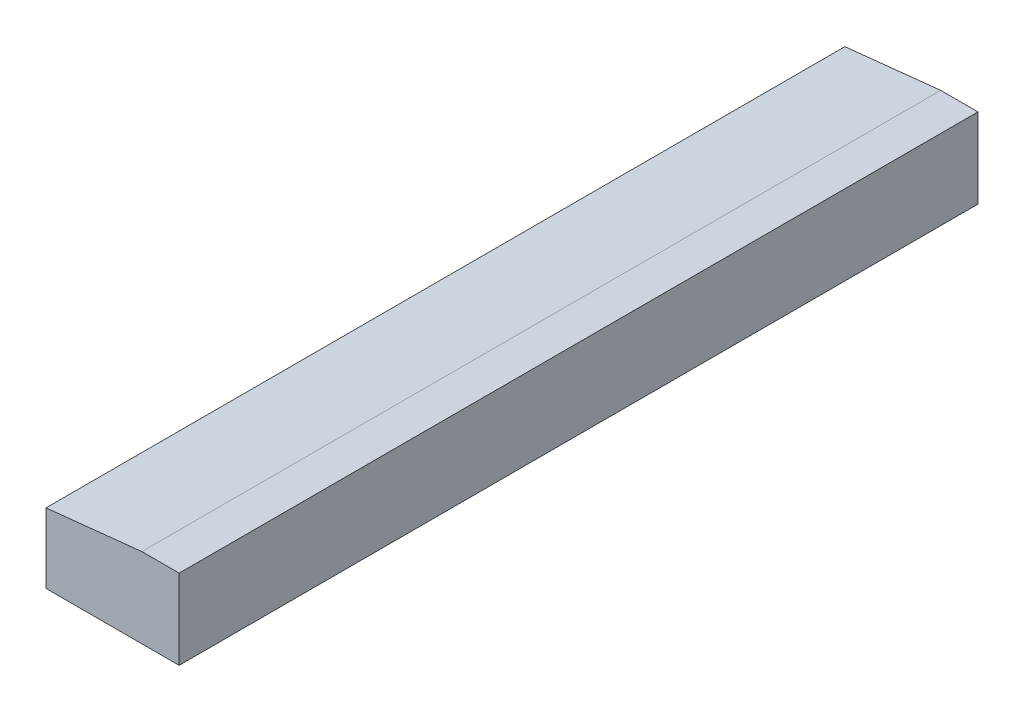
ISO-10303-21;
HEADER;
FILE_DESCRIPTION(('STEP AP214'),'2;1');
FILE_NAME('part.step','',(''),(''),'','','');
FILE_SCHEMA(('AUTOMOTIVE_DESIGN { 1 0 10303 214 1 1 1 1 }'));
ENDSEC;
DATA;
#1=APPLICATION_CONTEXT('core data for automotive mechanical design processes');
#2=APPLICATION_PROTOCOL_DEFINITION('international standard','automotive_design',2000,#1);
#3=PRODUCT_CONTEXT('',#1,'mechanical');
#4=PRODUCT('Part','Part','',(#3));
#5=PRODUCT_RELATED_PRODUCT_CATEGORY('part','',(#4));
#6=PRODUCT_DEFINITION_FORMATION('','',#4);
#7=PRODUCT_DEFINITION_CONTEXT('part definition',#1,'design');
#8=PRODUCT_DEFINITION('design','',#6,#7);
#9=PRODUCT_DEFINITION_SHAPE('','',#8);
#10=(LENGTH_UNIT() NAMED_UNIT(*) SI_UNIT(.MILLI.,.METRE.));
#11=(NAMED_UNIT(*) PLANE_ANGLE_UNIT() SI_UNIT($,.RADIAN.));
#12=(NAMED_UNIT(*) SI_UNIT($,.STERADIAN.) SOLID_ANGLE_UNIT());
#13=UNCERTAINTY_MEASURE_WITH_UNIT(LENGTH_MEASURE(1.E-05),#10,'distance_accuracy_value','');
#14=(GEOMETRIC_REPRESENTATION_CONTEXT(3) GLOBAL_UNCERTAINTY_ASSIGNED_CONTEXT((#13)) GLOBAL_UNIT_ASSIGNED_CONTEXT((#10,
#11,#12)) REPRESENTATION_CONTEXT('',''));
#15=CARTESIAN_POINT('',(0.,0.,0.));
#16=DIRECTION('',(0.,0.,1.));
#17=DIRECTION('',(1.,0.,0.));
#18=AXIS2_PLACEMENT_3D('',#15,#16,#17);
#19=CARTESIAN_POINT('',(0.,0.,150.));
#20=DIRECTION('',(1.,0.,0.));
#21=DIRECTION('',(0.,0.,-1.));
#22=AXIS2_PLACEMENT_3D('',#19,#20,#21);
#23=PLANE('',#22);
#24=DIRECTION('',(0.,-1.,0.));
#25=VECTOR('',#24,1.);
#26=CARTESIAN_POINT('',(0.,0.,0.));
#27=LINE('',#26,#25);
#28=CARTESIAN_POINT('',(0.,13.1081237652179,0.));
#29=VERTEX_POINT('',#28);
#30=CARTESIAN_POINT('',(0.,0.,0.));
#31=VERTEX_POINT('',#30);
#32=EDGE_CURVE('E76',#29,#31,#27,.T.);
#33=ORIENTED_EDGE('',*,*,#32,.T.);
#34=DIRECTION('',(0.,0.,-1.));
#35=VECTOR('',#34,1.);
#36=CARTESIAN_POINT('',(0.,0.,150.));
#37=LINE('',#36,#35);
#38=CARTESIAN_POINT('',(0.,0.,150.));
#39=VERTEX_POINT('',#38);
#40=EDGE_CURVE('E11',#39,#31,#37,.T.);
#41=ORIENTED_EDGE('',*,*,#40,.F.);
#42=DIRECTION('',(0.,-1.,0.));
#43=VECTOR('',#42,1.);
#44=CARTESIAN_POINT('',(0.,0.,150.));
#45=LINE('',#44,#43);
#46=CARTESIAN_POINT('',(0.,13.1081237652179,150.));
#47=VERTEX_POINT('',#46);
#48=EDGE_CURVE('E97',#47,#39,#45,.T.);
#49=ORIENTED_EDGE('',*,*,#48,.F.);
#50=DIRECTION('',(0.,0.,-1.));
#51=VECTOR('',#50,1.);
#52=CARTESIAN_POINT('',(0.,13.1081237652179,150.));
#53=LINE('',#52,#51);
#54=EDGE_CURVE('E89',#47,#29,#53,.T.);
#55=ORIENTED_EDGE('',*,*,#54,.T.);
#56=EDGE_LOOP('',(#33,#41,#49,#55));
#57=FACE_BOUND('',#56,.T.);
#58=ADVANCED_FACE('F26',(#57),#23,.F.);
#59=CARTESIAN_POINT('',(25.,0.,150.));
#60=DIRECTION('',(0.,1.,0.));
#61=DIRECTION('',(0.,0.,1.));
#62=AXIS2_PLACEMENT_3D('',#59,#60,#61);
#63=PLANE('',#62);
#64=DIRECTION('',(1.,0.,0.));
#65=VECTOR('',#64,1.);
#66=CARTESIAN_POINT('',(25.,0.,0.));
#67=LINE('',#66,#65);
#68=CARTESIAN_POINT('',(25.,0.,0.));
#69=VERTEX_POINT('',#68);
#70=EDGE_CURVE('E72',#31,#69,#67,.T.);
#71=ORIENTED_EDGE('',*,*,#70,.T.);
#72=DIRECTION('',(0.,0.,-1.));
#73=VECTOR('',#72,1.);
#74=CARTESIAN_POINT('',(25.,0.,150.));
#75=LINE('',#74,#73);
#76=CARTESIAN_POINT('',(25.,0.,150.));
#77=VERTEX_POINT('',#76);
#78=EDGE_CURVE('E33',#77,#69,#75,.T.);
#79=ORIENTED_EDGE('',*,*,#78,.F.);
#80=DIRECTION('',(1.,0.,0.));
#81=VECTOR('',#80,1.);
#82=CARTESIAN_POINT('',(25.,0.,150.));
#83=LINE('',#82,#81);
#84=EDGE_CURVE('E85',#39,#77,#83,.T.);
#85=ORIENTED_EDGE('',*,*,#84,.F.);
#86=ORIENTED_EDGE('',*,*,#40,.T.);
#87=EDGE_LOOP('',(#71,#79,#85,#86));
#88=FACE_BOUND('',#87,.T.);
#89=ADVANCED_FACE('F84',(#88),#63,.F.);
#90=CARTESIAN_POINT('',(25.,15.,150.));
#91=DIRECTION('',(-1.,0.,0.));
#92=DIRECTION('',(0.,0.,1.));
#93=AXIS2_PLACEMENT_3D('',#90,#91,#92);
#94=PLANE('',#93);
#95=DIRECTION('',(0.,1.,0.));
#96=VECTOR('',#95,1.);
#97=CARTESIAN_POINT('',(25.,15.,0.));
#98=LINE('',#97,#96);
#99=CARTESIAN_POINT('',(25.,15.,0.));
#100=VERTEX_POINT('',#99);
#101=EDGE_CURVE('E78',#69,#100,#98,.T.);
#102=ORIENTED_EDGE('',*,*,#101,.T.);
#103=DIRECTION('',(0.,0.,-1.));
#104=VECTOR('',#103,1.);
#105=CARTESIAN_POINT('',(25.,15.,150.));
#106=LINE('',#105,#104);
#107=CARTESIAN_POINT('',(25.,15.,150.));
#108=VERTEX_POINT('',#107);
#109=EDGE_CURVE('E108',#108,#100,#106,.T.);
#110=ORIENTED_EDGE('',*,*,#109,.F.);
#111=DIRECTION('',(0.,1.,0.));
#112=VECTOR('',#111,1.);
#113=CARTESIAN_POINT('',(25.,15.,150.));
#114=LINE('',#113,#112);
#115=EDGE_CURVE('E100',#77,#108,#114,.T.);
#116=ORIENTED_EDGE('',*,*,#115,.F.);
#117=ORIENTED_EDGE('',*,*,#78,.T.);
#118=EDGE_LOOP('',(#102,#110,#116,#117));
#119=FACE_BOUND('',#118,.T.);
#120=ADVANCED_FACE('F112',(#119),#94,.F.);
#121=CARTESIAN_POINT('',(18.,15.,150.));
#122=DIRECTION('',(0.,-1.,0.));
#123=DIRECTION('',(1.,0.,0.));
#124=AXIS2_PLACEMENT_3D('',#121,#122,#123);
#125=PLANE('',#124);
#126=DIRECTION('',(-1.,0.,0.));
#127=VECTOR('',#126,1.);
#128=CARTESIAN_POINT('',(18.,15.,0.));
#129=LINE('',#128,#127);
#130=CARTESIAN_POINT('',(18.,15.,0.));
#131=VERTEX_POINT('',#130);
#132=EDGE_CURVE('E93',#100,#131,#129,.T.);
#133=ORIENTED_EDGE('',*,*,#132,.T.);
#134=DIRECTION('',(0.,0.,-1.));
#135=VECTOR('',#134,1.);
#136=CARTESIAN_POINT('',(18.,15.,150.));
#137=LINE('',#136,#135);
#138=CARTESIAN_POINT('',(18.,15.,150.));
#139=VERTEX_POINT('',#138);
#140=EDGE_CURVE('E105',#139,#131,#137,.T.);
#141=ORIENTED_EDGE('',*,*,#140,.F.);
#142=DIRECTION('',(-1.,0.,0.));
#143=VECTOR('',#142,1.);
#144=CARTESIAN_POINT('',(18.,15.,150.));
#145=LINE('',#144,#143);
#146=EDGE_CURVE('E45',#108,#139,#145,.T.);
#147=ORIENTED_EDGE('',*,*,#146,.F.);
#148=ORIENTED_EDGE('',*,*,#109,.T.);
#149=EDGE_LOOP('',(#133,#141,#147,#148));
#150=FACE_BOUND('',#149,.T.);
#151=ADVANCED_FACE('F123',(#150),#125,.F.);
#152=CARTESIAN_POINT('',(0.,13.1081237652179,150.));
#153=DIRECTION('',(0.104528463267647,-0.994521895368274,0.));
#154=DIRECTION('',(0.994521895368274,0.104528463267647,0.));
#155=AXIS2_PLACEMENT_3D('',#152,#153,#154);
#156=PLANE('',#155);
#157=DIRECTION('',(-0.994521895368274,-0.104528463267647,0.));
#158=VECTOR('',#157,1.);
#159=CARTESIAN_POINT('',(0.,13.1081237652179,0.));
#160=LINE('',#159,#158);
#161=EDGE_CURVE('E95',#131,#29,#160,.T.);
#162=ORIENTED_EDGE('',*,*,#161,.T.);
#163=ORIENTED_EDGE('',*,*,#54,.F.);
#164=DIRECTION('',(-0.994521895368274,-0.104528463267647,0.));
#165=VECTOR('',#164,1.);
#166=CARTESIAN_POINT('',(0.,13.1081237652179,150.));
#167=LINE('',#166,#165);
#168=EDGE_CURVE('E40',#139,#47,#167,.T.);
#169=ORIENTED_EDGE('',*,*,#168,.F.);
#170=ORIENTED_EDGE('',*,*,#140,.T.);
#171=EDGE_LOOP('',(#162,#163,#169,#170));
#172=FACE_BOUND('',#171,.T.);
#173=ADVANCED_FACE('F116',(#172),#156,.F.);
#174=CARTESIAN_POINT('',(0.,0.,150.));
#175=DIRECTION('',(0.,0.,1.));
#176=DIRECTION('',(1.,0.,0.));
#177=AXIS2_PLACEMENT_3D('',#174,#175,#176);
#178=PLANE('',#177);
#179=ORIENTED_EDGE('',*,*,#48,.T.);
#180=ORIENTED_EDGE('',*,*,#84,.T.);
#181=ORIENTED_EDGE('',*,*,#115,.T.);
#182=ORIENTED_EDGE('',*,*,#146,.T.);
#183=ORIENTED_EDGE('',*,*,#168,.T.);
#184=EDGE_LOOP('',(#179,#180,#181,#182,#183));
#185=FACE_BOUND('',#184,.T.);
#186=ADVANCED_FACE('F114',(#185),#178,.T.);
#187=CARTESIAN_POINT('',(0.,0.,0.));
#188=DIRECTION('',(0.,0.,1.));
#189=DIRECTION('',(1.,0.,0.));
#190=AXIS2_PLACEMENT_3D('',#187,#188,#189);
#191=PLANE('',#190);
#192=ORIENTED_EDGE('',*,*,#32,.F.);
#193=ORIENTED_EDGE('',*,*,#161,.F.);
#194=ORIENTED_EDGE('',*,*,#132,.F.);
#195=ORIENTED_EDGE('',*,*,#101,.F.);
#196=ORIENTED_EDGE('',*,*,#70,.F.);
#197=EDGE_LOOP('',(#192,#193,#194,#195,#196));
#198=FACE_BOUND('',#197,.T.);
#199=ADVANCED_FACE('F73',(#198),#191,.F.);
#200=CLOSED_SHELL('',(#58,#89,#120,#151,#173,#186,#199));
#201=MANIFOLD_SOLID_BREP('B2',#200);
#202=ADVANCED_BREP_SHAPE_REPRESENTATION('',(#18,#201),#14);
#203=SHAPE_DEFINITION_REPRESENTATION(#9,#202);
ENDSEC;
END-ISO-10303-21;
